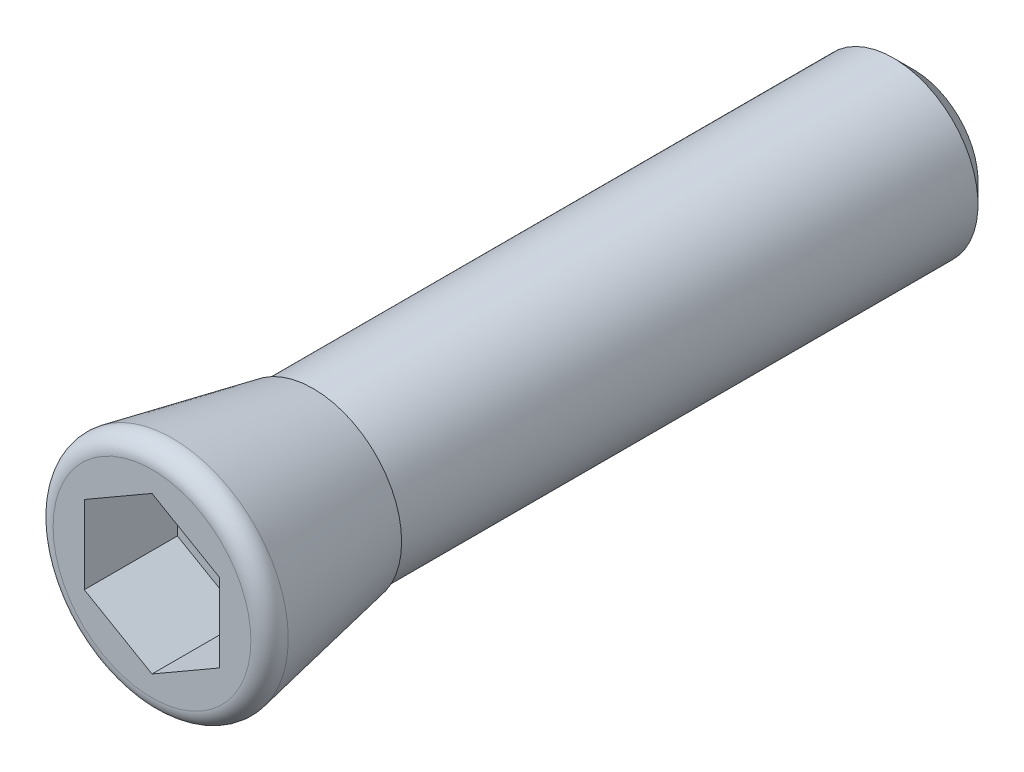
ISO-10303-21;
HEADER;
FILE_DESCRIPTION(('STEP AP214'),'2;1');
FILE_NAME('part.step','',(''),(''),'','','');
FILE_SCHEMA(('AUTOMOTIVE_DESIGN { 1 0 10303 214 1 1 1 1 }'));
ENDSEC;
DATA;
#1=APPLICATION_CONTEXT('core data for automotive mechanical design processes');
#2=APPLICATION_PROTOCOL_DEFINITION('international standard','automotive_design',2000,#1);
#3=PRODUCT_CONTEXT('',#1,'mechanical');
#4=PRODUCT('Part','Part','',(#3));
#5=PRODUCT_RELATED_PRODUCT_CATEGORY('part','',(#4));
#6=PRODUCT_DEFINITION_FORMATION('','',#4);
#7=PRODUCT_DEFINITION_CONTEXT('part definition',#1,'design');
#8=PRODUCT_DEFINITION('design','',#6,#7);
#9=PRODUCT_DEFINITION_SHAPE('','',#8);
#10=(LENGTH_UNIT() NAMED_UNIT(*) SI_UNIT(.MILLI.,.METRE.));
#11=(NAMED_UNIT(*) PLANE_ANGLE_UNIT() SI_UNIT($,.RADIAN.));
#12=(NAMED_UNIT(*) SI_UNIT($,.STERADIAN.) SOLID_ANGLE_UNIT());
#13=UNCERTAINTY_MEASURE_WITH_UNIT(LENGTH_MEASURE(1.E-05),#10,'distance_accuracy_value','');
#14=(GEOMETRIC_REPRESENTATION_CONTEXT(3) GLOBAL_UNCERTAINTY_ASSIGNED_CONTEXT((#13)) GLOBAL_UNIT_ASSIGNED_CONTEXT((#10,
#11,#12)) REPRESENTATION_CONTEXT('',''));
#15=CARTESIAN_POINT('',(0.,0.,0.));
#16=DIRECTION('',(0.,0.,1.));
#17=DIRECTION('',(1.,0.,0.));
#18=AXIS2_PLACEMENT_3D('',#15,#16,#17);
#19=CARTESIAN_POINT('',(0.,0.,-9.509));
#20=DIRECTION('',(0.,0.,-1.));
#21=DIRECTION('',(-1.,0.,0.));
#22=AXIS2_PLACEMENT_3D('',#19,#20,#21);
#23=CYLINDRICAL_SURFACE('',#22,5.);
#24=CARTESIAN_POINT('',(0.,0.,-43.799));
#25=DIRECTION('',(0.,0.,-1.));
#26=DIRECTION('',(-1.,0.,0.));
#27=AXIS2_PLACEMENT_3D('',#24,#25,#26);
#28=CIRCLE('',#27,5.);
#29=CARTESIAN_POINT('',(-5.,0.,-43.799));
#30=VERTEX_POINT('',#29);
#31=EDGE_CURVE('E9',#30,#30,#28,.F.);
#32=ORIENTED_EDGE('',*,*,#31,.T.);
#33=EDGE_LOOP('',(#32));
#34=FACE_BOUND('',#33,.T.);
#35=CARTESIAN_POINT('',(0.,0.,-9.525));
#36=DIRECTION('',(0.,0.,-1.));
#37=DIRECTION('',(-1.,0.,0.));
#38=AXIS2_PLACEMENT_3D('',#35,#36,#37);
#39=CIRCLE('',#38,5.);
#40=CARTESIAN_POINT('',(-5.,0.,-9.525));
#41=VERTEX_POINT('',#40);
#42=EDGE_CURVE('E132',#41,#41,#39,.T.);
#43=ORIENTED_EDGE('',*,*,#42,.T.);
#44=EDGE_LOOP('',(#43));
#45=FACE_BOUND('',#44,.T.);
#46=ADVANCED_FACE('F14',(#34,#45),#23,.T.);
#47=CARTESIAN_POINT('',(0.,0.,0.));
#48=DIRECTION('',(0.,0.,1.));
#49=DIRECTION('',(1.,0.,0.));
#50=AXIS2_PLACEMENT_3D('',#47,#48,#49);
#51=PLANE('',#50);
#52=DIRECTION('',(0.866025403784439,-0.5,0.));
#53=VECTOR('',#52,1.);
#54=CARTESIAN_POINT('',(-4.,-2.30940107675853,0.));
#55=LINE('',#54,#53);
#56=CARTESIAN_POINT('',(-4.,-2.30940107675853,0.));
#57=VERTEX_POINT('',#56);
#58=CARTESIAN_POINT('',(0.,-4.61880215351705,0.));
#59=VERTEX_POINT('',#58);
#60=EDGE_CURVE('E29',#57,#59,#55,.T.);
#61=ORIENTED_EDGE('',*,*,#60,.F.);
#62=DIRECTION('',(0.,-1.,0.));
#63=VECTOR('',#62,1.);
#64=CARTESIAN_POINT('',(-4.,2.30940107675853,0.));
#65=LINE('',#64,#63);
#66=CARTESIAN_POINT('',(-4.,2.30940107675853,0.));
#67=VERTEX_POINT('',#66);
#68=EDGE_CURVE('E99',#67,#57,#65,.T.);
#69=ORIENTED_EDGE('',*,*,#68,.F.);
#70=DIRECTION('',(-0.866025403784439,-0.5,0.));
#71=VECTOR('',#70,1.);
#72=CARTESIAN_POINT('',(0.,4.61880215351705,0.));
#73=LINE('',#72,#71);
#74=CARTESIAN_POINT('',(0.,4.61880215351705,0.));
#75=VERTEX_POINT('',#74);
#76=EDGE_CURVE('E93',#75,#67,#73,.T.);
#77=ORIENTED_EDGE('',*,*,#76,.F.);
#78=DIRECTION('',(-0.866025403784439,0.5,0.));
#79=VECTOR('',#78,1.);
#80=CARTESIAN_POINT('',(4.,2.30940107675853,0.));
#81=LINE('',#80,#79);
#82=CARTESIAN_POINT('',(4.,2.30940107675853,0.));
#83=VERTEX_POINT('',#82);
#84=EDGE_CURVE('E91',#83,#75,#81,.T.);
#85=ORIENTED_EDGE('',*,*,#84,.F.);
#86=DIRECTION('',(0.,1.,0.));
#87=VECTOR('',#86,1.);
#88=CARTESIAN_POINT('',(4.,-2.30940107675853,0.));
#89=LINE('',#88,#87);
#90=CARTESIAN_POINT('',(4.,-2.30940107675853,0.));
#91=VERTEX_POINT('',#90);
#92=EDGE_CURVE('E72',#91,#83,#89,.T.);
#93=ORIENTED_EDGE('',*,*,#92,.F.);
#94=DIRECTION('',(0.866025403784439,0.5,0.));
#95=VECTOR('',#94,1.);
#96=CARTESIAN_POINT('',(0.,-4.61880215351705,0.));
#97=LINE('',#96,#95);
#98=EDGE_CURVE('E83',#59,#91,#97,.T.);
#99=ORIENTED_EDGE('',*,*,#98,.F.);
#100=EDGE_LOOP('',(#61,#69,#77,#85,#93,#99));
#101=FACE_BOUND('',#100,.T.);
#102=CARTESIAN_POINT('',(0.,0.,0.));
#103=DIRECTION('',(0.,0.,1.));
#104=DIRECTION('',(1.,0.,0.));
#105=AXIS2_PLACEMENT_3D('',#102,#103,#104);
#106=CIRCLE('',#105,5.842);
#107=CARTESIAN_POINT('',(5.842,0.,0.));
#108=VERTEX_POINT('',#107);
#109=EDGE_CURVE('E117',#108,#108,#106,.T.);
#110=ORIENTED_EDGE('',*,*,#109,.T.);
#111=EDGE_LOOP('',(#110));
#112=FACE_BOUND('',#111,.T.);
#113=ADVANCED_FACE('F87',(#101,#112),#51,.T.);
#114=CARTESIAN_POINT('',(0.,0.,-1.20986193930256));
#115=DIRECTION('',(0.,0.,1.));
#116=DIRECTION('',(1.,0.,0.));
#117=AXIS2_PLACEMENT_3D('',#114,#115,#116);
#118=CONICAL_SURFACE('',#117,6.83933321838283,0.191986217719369);
#119=CARTESIAN_POINT('',(0.,0.,-9.525));
#120=DIRECTION('',(0.,0.,-1.));
#121=DIRECTION('',(-1.,0.,0.));
#122=AXIS2_PLACEMENT_3D('',#119,#120,#121);
#123=CIRCLE('',#122,5.22303411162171);
#124=CARTESIAN_POINT('',(-5.22303411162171,0.,-9.525));
#125=VERTEX_POINT('',#124);
#126=EDGE_CURVE('E129',#125,#125,#123,.T.);
#127=ORIENTED_EDGE('',*,*,#126,.F.);
#128=EDGE_LOOP('',(#127));
#129=FACE_BOUND('',#128,.T.);
#130=CARTESIAN_POINT('',(0.,0.,-1.20986193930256));
#131=DIRECTION('',(0.,0.,1.));
#132=DIRECTION('',(1.,0.,0.));
#133=AXIS2_PLACEMENT_3D('',#130,#131,#132);
#134=CIRCLE('',#133,6.83933321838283);
#135=CARTESIAN_POINT('',(6.83933321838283,0.,-1.20986193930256));
#136=VERTEX_POINT('',#135);
#137=EDGE_CURVE('E126',#136,#136,#134,.T.);
#138=ORIENTED_EDGE('',*,*,#137,.F.);
#139=EDGE_LOOP('',(#138));
#140=FACE_BOUND('',#139,.T.);
#141=ADVANCED_FACE('F161',(#129,#140),#118,.T.);
#142=CARTESIAN_POINT('',(0.,0.,-1.016));
#143=DIRECTION('',(0.,0.,1.));
#144=DIRECTION('',(1.,0.,0.));
#145=AXIS2_PLACEMENT_3D('',#142,#143,#144);
#146=TOROIDAL_SURFACE('',#145,5.842,1.016);
#147=ORIENTED_EDGE('',*,*,#137,.T.);
#148=EDGE_LOOP('',(#147));
#149=FACE_BOUND('',#148,.T.);
#150=ORIENTED_EDGE('',*,*,#109,.F.);
#151=EDGE_LOOP('',(#150));
#152=FACE_BOUND('',#151,.T.);
#153=ADVANCED_FACE('F164',(#149,#152),#146,.T.);
#154=CARTESIAN_POINT('',(0.,7.112,-9.525));
#155=DIRECTION('',(0.,0.,-1.));
#156=DIRECTION('',(-1.,0.,0.));
#157=AXIS2_PLACEMENT_3D('',#154,#155,#156);
#158=PLANE('',#157);
#159=ORIENTED_EDGE('',*,*,#42,.F.);
#160=EDGE_LOOP('',(#159));
#161=FACE_BOUND('',#160,.T.);
#162=ORIENTED_EDGE('',*,*,#126,.T.);
#163=EDGE_LOOP('',(#162));
#164=FACE_BOUND('',#163,.T.);
#165=ADVANCED_FACE('F16',(#161,#164),#158,.T.);
#166=CARTESIAN_POINT('',(0.,0.,-44.999));
#167=DIRECTION('',(0.,0.,-1.));
#168=DIRECTION('',(-1.,0.,0.));
#169=AXIS2_PLACEMENT_3D('',#166,#167,#168);
#170=PLANE('',#169);
#171=CARTESIAN_POINT('',(0.,0.,-44.999));
#172=DIRECTION('',(0.,0.,-1.));
#173=DIRECTION('',(-1.,0.,0.));
#174=AXIS2_PLACEMENT_3D('',#171,#172,#173);
#175=CIRCLE('',#174,3.8);
#176=CARTESIAN_POINT('',(-3.8,0.,-44.999));
#177=VERTEX_POINT('',#176);
#178=EDGE_CURVE('E22',#177,#177,#175,.T.);
#179=ORIENTED_EDGE('',*,*,#178,.T.);
#180=EDGE_LOOP('',(#179));
#181=FACE_BOUND('',#180,.T.);
#182=ADVANCED_FACE('F137',(#181),#170,.T.);
#183=CARTESIAN_POINT('',(0.,0.,-44.999));
#184=DIRECTION('',(0.,0.,1.));
#185=DIRECTION('',(1.,0.,0.));
#186=AXIS2_PLACEMENT_3D('',#183,#184,#185);
#187=CONICAL_SURFACE('',#186,3.8,0.785398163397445);
#188=ORIENTED_EDGE('',*,*,#31,.F.);
#189=EDGE_LOOP('',(#188));
#190=FACE_BOUND('',#189,.T.);
#191=ORIENTED_EDGE('',*,*,#178,.F.);
#192=EDGE_LOOP('',(#191));
#193=FACE_BOUND('',#192,.T.);
#194=ADVANCED_FACE('F139',(#190,#193),#187,.T.);
#195=CARTESIAN_POINT('',(-4.,-2.30940107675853,-5.5));
#196=DIRECTION('',(-0.5,-0.866025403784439,0.));
#197=DIRECTION('',(-0.866025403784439,0.5,0.));
#198=AXIS2_PLACEMENT_3D('',#195,#196,#197);
#199=PLANE('',#198);
#200=ORIENTED_EDGE('',*,*,#60,.T.);
#201=DIRECTION('',(0.,0.,1.));
#202=VECTOR('',#201,1.);
#203=CARTESIAN_POINT('',(0.,-4.61880215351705,-5.5));
#204=LINE('',#203,#202);
#205=CARTESIAN_POINT('',(0.,-4.61880215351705,-5.5));
#206=VERTEX_POINT('',#205);
#207=EDGE_CURVE('E80',#206,#59,#204,.T.);
#208=ORIENTED_EDGE('',*,*,#207,.F.);
#209=DIRECTION('',(0.866025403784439,-0.5,0.));
#210=VECTOR('',#209,1.);
#211=CARTESIAN_POINT('',(-4.,-2.30940107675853,-5.5));
#212=LINE('',#211,#210);
#213=CARTESIAN_POINT('',(-4.,-2.30940107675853,-5.5));
#214=VERTEX_POINT('',#213);
#215=EDGE_CURVE('E101',#214,#206,#212,.T.);
#216=ORIENTED_EDGE('',*,*,#215,.F.);
#217=DIRECTION('',(0.,0.,1.));
#218=VECTOR('',#217,1.);
#219=CARTESIAN_POINT('',(-4.,-2.30940107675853,-5.5));
#220=LINE('',#219,#218);
#221=EDGE_CURVE('E36',#214,#57,#220,.T.);
#222=ORIENTED_EDGE('',*,*,#221,.T.);
#223=EDGE_LOOP('',(#200,#208,#216,#222));
#224=FACE_BOUND('',#223,.T.);
#225=ADVANCED_FACE('F141',(#224),#199,.F.);
#226=CARTESIAN_POINT('',(-4.,2.30940107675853,-5.5));
#227=DIRECTION('',(-1.,0.,0.));
#228=DIRECTION('',(0.,0.,1.));
#229=AXIS2_PLACEMENT_3D('',#226,#227,#228);
#230=PLANE('',#229);
#231=ORIENTED_EDGE('',*,*,#68,.T.);
#232=ORIENTED_EDGE('',*,*,#221,.F.);
#233=DIRECTION('',(0.,-1.,0.));
#234=VECTOR('',#233,1.);
#235=CARTESIAN_POINT('',(-4.,2.30940107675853,-5.5));
#236=LINE('',#235,#234);
#237=CARTESIAN_POINT('',(-4.,2.30940107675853,-5.5));
#238=VERTEX_POINT('',#237);
#239=EDGE_CURVE('E113',#238,#214,#236,.T.);
#240=ORIENTED_EDGE('',*,*,#239,.F.);
#241=DIRECTION('',(0.,0.,1.));
#242=VECTOR('',#241,1.);
#243=CARTESIAN_POINT('',(-4.,2.30940107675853,-5.5));
#244=LINE('',#243,#242);
#245=EDGE_CURVE('E118',#238,#67,#244,.T.);
#246=ORIENTED_EDGE('',*,*,#245,.T.);
#247=EDGE_LOOP('',(#231,#232,#240,#246));
#248=FACE_BOUND('',#247,.T.);
#249=ADVANCED_FACE('F150',(#248),#230,.F.);
#250=CARTESIAN_POINT('',(0.,4.61880215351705,-5.5));
#251=DIRECTION('',(-0.5,0.866025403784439,0.));
#252=DIRECTION('',(0.866025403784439,0.5,0.));
#253=AXIS2_PLACEMENT_3D('',#250,#251,#252);
#254=PLANE('',#253);
#255=ORIENTED_EDGE('',*,*,#76,.T.);
#256=ORIENTED_EDGE('',*,*,#245,.F.);
#257=DIRECTION('',(-0.866025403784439,-0.5,0.));
#258=VECTOR('',#257,1.);
#259=CARTESIAN_POINT('',(0.,4.61880215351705,-5.5));
#260=LINE('',#259,#258);
#261=CARTESIAN_POINT('',(0.,4.61880215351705,-5.5));
#262=VERTEX_POINT('',#261);
#263=EDGE_CURVE('E110',#262,#238,#260,.T.);
#264=ORIENTED_EDGE('',*,*,#263,.F.);
#265=DIRECTION('',(0.,0.,1.));
#266=VECTOR('',#265,1.);
#267=CARTESIAN_POINT('',(0.,4.61880215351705,-5.5));
#268=LINE('',#267,#266);
#269=EDGE_CURVE('E120',#262,#75,#268,.T.);
#270=ORIENTED_EDGE('',*,*,#269,.T.);
#271=EDGE_LOOP('',(#255,#256,#264,#270));
#272=FACE_BOUND('',#271,.T.);
#273=ADVANCED_FACE('F234',(#272),#254,.F.);
#274=CARTESIAN_POINT('',(4.,2.30940107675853,-5.5));
#275=DIRECTION('',(0.5,0.866025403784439,0.));
#276=DIRECTION('',(0.866025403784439,-0.5,0.));
#277=AXIS2_PLACEMENT_3D('',#274,#275,#276);
#278=PLANE('',#277);
#279=ORIENTED_EDGE('',*,*,#84,.T.);
#280=ORIENTED_EDGE('',*,*,#269,.F.);
#281=DIRECTION('',(-0.866025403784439,0.5,0.));
#282=VECTOR('',#281,1.);
#283=CARTESIAN_POINT('',(4.,2.30940107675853,-5.5));
#284=LINE('',#283,#282);
#285=CARTESIAN_POINT('',(4.,2.30940107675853,-5.5));
#286=VERTEX_POINT('',#285);
#287=EDGE_CURVE('E107',#286,#262,#284,.T.);
#288=ORIENTED_EDGE('',*,*,#287,.F.);
#289=DIRECTION('',(0.,0.,1.));
#290=VECTOR('',#289,1.);
#291=CARTESIAN_POINT('',(4.,2.30940107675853,-5.5));
#292=LINE('',#291,#290);
#293=EDGE_CURVE('E79',#286,#83,#292,.T.);
#294=ORIENTED_EDGE('',*,*,#293,.T.);
#295=EDGE_LOOP('',(#279,#280,#288,#294));
#296=FACE_BOUND('',#295,.T.);
#297=ADVANCED_FACE('F241',(#296),#278,.F.);
#298=CARTESIAN_POINT('',(4.,-2.30940107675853,-5.5));
#299=DIRECTION('',(1.,0.,0.));
#300=DIRECTION('',(0.,0.,-1.));
#301=AXIS2_PLACEMENT_3D('',#298,#299,#300);
#302=PLANE('',#301);
#303=ORIENTED_EDGE('',*,*,#92,.T.);
#304=ORIENTED_EDGE('',*,*,#293,.F.);
#305=DIRECTION('',(0.,1.,0.));
#306=VECTOR('',#305,1.);
#307=CARTESIAN_POINT('',(4.,-2.30940107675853,-5.5));
#308=LINE('',#307,#306);
#309=CARTESIAN_POINT('',(4.,-2.30940107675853,-5.5));
#310=VERTEX_POINT('',#309);
#311=EDGE_CURVE('E75',#310,#286,#308,.T.);
#312=ORIENTED_EDGE('',*,*,#311,.F.);
#313=DIRECTION('',(0.,0.,1.));
#314=VECTOR('',#313,1.);
#315=CARTESIAN_POINT('',(4.,-2.30940107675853,-5.5));
#316=LINE('',#315,#314);
#317=EDGE_CURVE('E68',#310,#91,#316,.T.);
#318=ORIENTED_EDGE('',*,*,#317,.T.);
#319=EDGE_LOOP('',(#303,#304,#312,#318));
#320=FACE_BOUND('',#319,.T.);
#321=ADVANCED_FACE('F70',(#320),#302,.F.);
#322=CARTESIAN_POINT('',(0.,-4.61880215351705,-5.5));
#323=DIRECTION('',(0.5,-0.866025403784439,0.));
#324=DIRECTION('',(-0.866025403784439,-0.5,0.));
#325=AXIS2_PLACEMENT_3D('',#322,#323,#324);
#326=PLANE('',#325);
#327=ORIENTED_EDGE('',*,*,#98,.T.);
#328=ORIENTED_EDGE('',*,*,#317,.F.);
#329=DIRECTION('',(0.866025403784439,0.5,0.));
#330=VECTOR('',#329,1.);
#331=CARTESIAN_POINT('',(0.,-4.61880215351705,-5.5));
#332=LINE('',#331,#330);
#333=EDGE_CURVE('E104',#206,#310,#332,.T.);
#334=ORIENTED_EDGE('',*,*,#333,.F.);
#335=ORIENTED_EDGE('',*,*,#207,.T.);
#336=EDGE_LOOP('',(#327,#328,#334,#335));
#337=FACE_BOUND('',#336,.T.);
#338=ADVANCED_FACE('F84',(#337),#326,.F.);
#339=CARTESIAN_POINT('',(-8.,0.,-5.5));
#340=DIRECTION('',(0.,0.,-1.));
#341=DIRECTION('',(-1.,0.,0.));
#342=AXIS2_PLACEMENT_3D('',#339,#340,#341);
#343=PLANE('',#342);
#344=ORIENTED_EDGE('',*,*,#215,.T.);
#345=ORIENTED_EDGE('',*,*,#333,.T.);
#346=ORIENTED_EDGE('',*,*,#311,.T.);
#347=ORIENTED_EDGE('',*,*,#287,.T.);
#348=ORIENTED_EDGE('',*,*,#263,.T.);
#349=ORIENTED_EDGE('',*,*,#239,.T.);
#350=EDGE_LOOP('',(#344,#345,#346,#347,#348,#349));
#351=FACE_BOUND('',#350,.T.);
#352=ADVANCED_FACE('F265',(#351),#343,.F.);
#353=CLOSED_SHELL('',(#46,#113,#141,#153,#165,#182,#194,#225,#249,#273,#297,#321,#338,#352));
#354=MANIFOLD_SOLID_BREP('B1',#353);
#355=ADVANCED_BREP_SHAPE_REPRESENTATION('',(#18,#354),#14);
#356=SHAPE_DEFINITION_REPRESENTATION(#9,#355);
ENDSEC;
END-ISO-10303-21;
